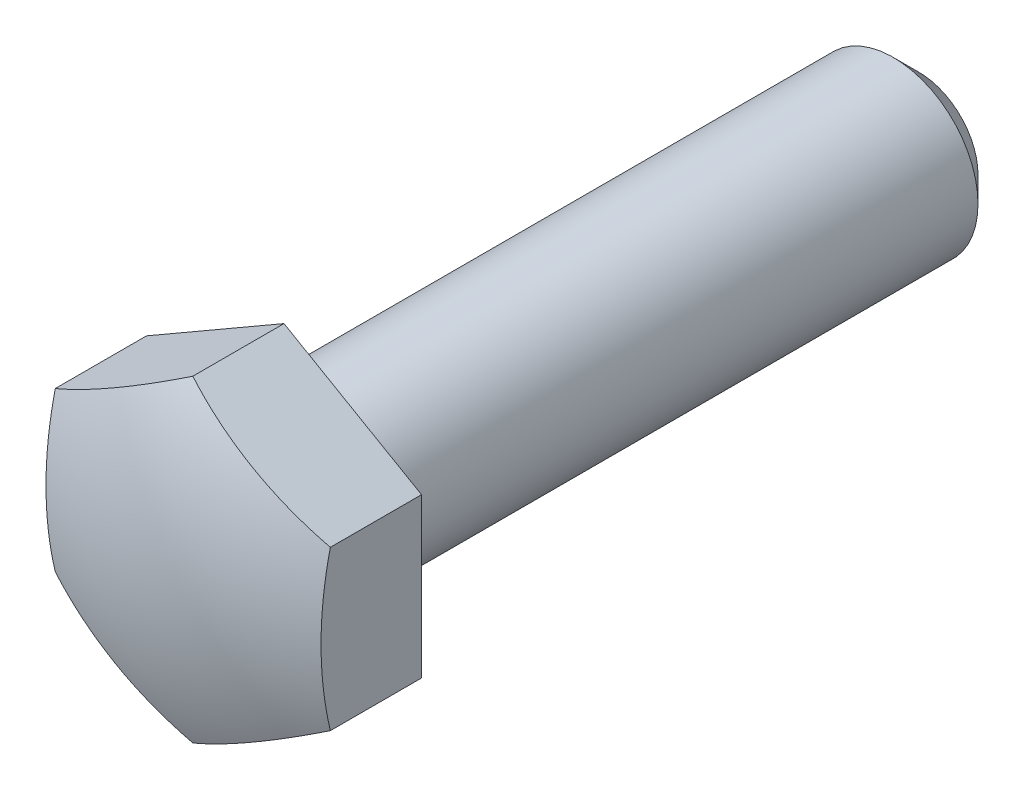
ISO-10303-21;
HEADER;
FILE_DESCRIPTION(('STEP AP214'),'2;1');
FILE_NAME('part.step','',(''),(''),'','','');
FILE_SCHEMA(('AUTOMOTIVE_DESIGN { 1 0 10303 214 1 1 1 1 }'));
ENDSEC;
DATA;
#1=APPLICATION_CONTEXT('core data for automotive mechanical design processes');
#2=APPLICATION_PROTOCOL_DEFINITION('international standard','automotive_design',2000,#1);
#3=PRODUCT_CONTEXT('',#1,'mechanical');
#4=PRODUCT('Part','Part','',(#3));
#5=PRODUCT_RELATED_PRODUCT_CATEGORY('part','',(#4));
#6=PRODUCT_DEFINITION_FORMATION('','',#4);
#7=PRODUCT_DEFINITION_CONTEXT('part definition',#1,'design');
#8=PRODUCT_DEFINITION('design','',#6,#7);
#9=PRODUCT_DEFINITION_SHAPE('','',#8);
#10=(LENGTH_UNIT() NAMED_UNIT(*) SI_UNIT(.MILLI.,.METRE.));
#11=(NAMED_UNIT(*) PLANE_ANGLE_UNIT() SI_UNIT($,.RADIAN.));
#12=(NAMED_UNIT(*) SI_UNIT($,.STERADIAN.) SOLID_ANGLE_UNIT());
#13=UNCERTAINTY_MEASURE_WITH_UNIT(LENGTH_MEASURE(1.E-05),#10,'distance_accuracy_value','');
#14=(GEOMETRIC_REPRESENTATION_CONTEXT(3) GLOBAL_UNCERTAINTY_ASSIGNED_CONTEXT((#13)) GLOBAL_UNIT_ASSIGNED_CONTEXT((#10,
#11,#12)) REPRESENTATION_CONTEXT('',''));
#15=CARTESIAN_POINT('',(0.,0.,0.));
#16=DIRECTION('',(0.,0.,1.));
#17=DIRECTION('',(1.,0.,0.));
#18=AXIS2_PLACEMENT_3D('',#15,#16,#17);
#19=CARTESIAN_POINT('',(4.,0.,0.));
#20=DIRECTION('',(0.,0.,1.));
#21=DIRECTION('',(1.,0.,0.));
#22=AXIS2_PLACEMENT_3D('',#19,#20,#21);
#23=PLANE('',#22);
#24=CARTESIAN_POINT('',(0.,0.,0.));
#25=DIRECTION('',(0.,0.,1.));
#26=DIRECTION('',(1.,0.,0.));
#27=AXIS2_PLACEMENT_3D('',#24,#25,#26);
#28=CIRCLE('',#27,4.);
#29=CARTESIAN_POINT('',(4.,0.,0.));
#30=VERTEX_POINT('',#29);
#31=EDGE_CURVE('E115',#30,#30,#28,.T.);
#32=ORIENTED_EDGE('',*,*,#31,.T.);
#33=EDGE_LOOP('',(#32));
#34=FACE_BOUND('',#33,.T.);
#35=DIRECTION('',(-0.86602540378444,-0.5,0.));
#36=VECTOR('',#35,1.);
#37=CARTESIAN_POINT('',(6.5,-3.75277674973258,0.));
#38=LINE('',#37,#36);
#39=CARTESIAN_POINT('',(6.5,-3.75277674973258,0.));
#40=VERTEX_POINT('',#39);
#41=CARTESIAN_POINT('',(0.,-7.50555349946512,0.));
#42=VERTEX_POINT('',#41);
#43=EDGE_CURVE('E89',#40,#42,#38,.T.);
#44=ORIENTED_EDGE('',*,*,#43,.T.);
#45=DIRECTION('',(0.86602540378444,-0.5,0.));
#46=VECTOR('',#45,1.);
#47=CARTESIAN_POINT('',(-6.5,-3.75277674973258,0.));
#48=LINE('',#47,#46);
#49=CARTESIAN_POINT('',(-6.5,-3.75277674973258,0.));
#50=VERTEX_POINT('',#49);
#51=EDGE_CURVE('E87',#50,#42,#48,.T.);
#52=ORIENTED_EDGE('',*,*,#51,.F.);
#53=DIRECTION('',(0.,-1.,0.));
#54=VECTOR('',#53,1.);
#55=CARTESIAN_POINT('',(-6.5,3.75277674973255,0.));
#56=LINE('',#55,#54);
#57=CARTESIAN_POINT('',(-6.5,3.75277674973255,0.));
#58=VERTEX_POINT('',#57);
#59=EDGE_CURVE('E37',#58,#50,#56,.T.);
#60=ORIENTED_EDGE('',*,*,#59,.F.);
#61=DIRECTION('',(0.866025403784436,0.5,0.));
#62=VECTOR('',#61,1.);
#63=CARTESIAN_POINT('',(-6.5,3.75277674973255,0.));
#64=LINE('',#63,#62);
#65=CARTESIAN_POINT('',(0.,7.50555349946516,0.));
#66=VERTEX_POINT('',#65);
#67=EDGE_CURVE('E77',#58,#66,#64,.T.);
#68=ORIENTED_EDGE('',*,*,#67,.T.);
#69=DIRECTION('',(-0.866025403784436,0.5,0.));
#70=VECTOR('',#69,1.);
#71=CARTESIAN_POINT('',(6.5,3.75277674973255,0.));
#72=LINE('',#71,#70);
#73=CARTESIAN_POINT('',(6.5,3.75277674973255,0.));
#74=VERTEX_POINT('',#73);
#75=EDGE_CURVE('E83',#74,#66,#72,.T.);
#76=ORIENTED_EDGE('',*,*,#75,.F.);
#77=DIRECTION('',(0.,-1.,0.));
#78=VECTOR('',#77,1.);
#79=CARTESIAN_POINT('',(6.5,3.75277674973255,0.));
#80=LINE('',#79,#78);
#81=EDGE_CURVE('E95',#74,#40,#80,.T.);
#82=ORIENTED_EDGE('',*,*,#81,.T.);
#83=EDGE_LOOP('',(#44,#52,#60,#68,#76,#82));
#84=FACE_BOUND('',#83,.T.);
#85=ADVANCED_FACE('F14',(#34,#84),#23,.F.);
#86=CARTESIAN_POINT('',(0.,0.,30.));
#87=DIRECTION('',(0.,0.,1.));
#88=DIRECTION('',(1.,0.,0.));
#89=AXIS2_PLACEMENT_3D('',#86,#87,#88);
#90=CYLINDRICAL_SURFACE('',#89,4.);
#91=CARTESIAN_POINT('',(0.,0.,-28.8));
#92=DIRECTION('',(0.,0.,1.));
#93=DIRECTION('',(1.,0.,0.));
#94=AXIS2_PLACEMENT_3D('',#91,#92,#93);
#95=CIRCLE('',#94,4.);
#96=CARTESIAN_POINT('',(4.,0.,-28.8));
#97=VERTEX_POINT('',#96);
#98=EDGE_CURVE('E22',#97,#97,#95,.T.);
#99=ORIENTED_EDGE('',*,*,#98,.T.);
#100=EDGE_LOOP('',(#99));
#101=FACE_BOUND('',#100,.T.);
#102=ORIENTED_EDGE('',*,*,#31,.F.);
#103=EDGE_LOOP('',(#102));
#104=FACE_BOUND('',#103,.T.);
#105=ADVANCED_FACE('F120',(#101,#104),#90,.T.);
#106=CARTESIAN_POINT('',(0.,0.,-30.));
#107=DIRECTION('',(0.,0.,1.));
#108=DIRECTION('',(1.,0.,0.));
#109=AXIS2_PLACEMENT_3D('',#106,#107,#108);
#110=PLANE('',#109);
#111=CARTESIAN_POINT('',(0.,0.,-30.));
#112=DIRECTION('',(0.,0.,1.));
#113=DIRECTION('',(1.,0.,0.));
#114=AXIS2_PLACEMENT_3D('',#111,#112,#113);
#115=CIRCLE('',#114,2.8);
#116=CARTESIAN_POINT('',(2.8,0.,-30.));
#117=VERTEX_POINT('',#116);
#118=EDGE_CURVE('E9',#117,#117,#115,.F.);
#119=ORIENTED_EDGE('',*,*,#118,.T.);
#120=EDGE_LOOP('',(#119));
#121=FACE_BOUND('',#120,.T.);
#122=ADVANCED_FACE('F141',(#121),#110,.F.);
#123=CARTESIAN_POINT('',(6.5,-3.75277674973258,6.));
#124=DIRECTION('',(0.5,-0.86602540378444,0.));
#125=DIRECTION('',(0.86602540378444,0.5,0.));
#126=AXIS2_PLACEMENT_3D('',#123,#124,#125);
#127=PLANE('',#126);
#128=DIRECTION('',(0.,0.,-1.));
#129=VECTOR('',#128,1.);
#130=CARTESIAN_POINT('',(0.,-7.50555349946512,6.));
#131=LINE('',#130,#129);
#132=CARTESIAN_POINT('',(0.,-7.50555349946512,4.3087528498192));
#133=VERTEX_POINT('',#132);
#134=EDGE_CURVE('E29',#133,#42,#131,.T.);
#135=ORIENTED_EDGE('',*,*,#134,.T.);
#136=ORIENTED_EDGE('',*,*,#43,.F.);
#137=DIRECTION('',(0.,0.,-1.));
#138=VECTOR('',#137,1.);
#139=CARTESIAN_POINT('',(6.5,-3.75277674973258,6.));
#140=LINE('',#139,#138);
#141=CARTESIAN_POINT('',(6.5,-3.75277674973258,4.3087528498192));
#142=VERTEX_POINT('',#141);
#143=EDGE_CURVE('E100',#142,#40,#140,.T.);
#144=ORIENTED_EDGE('',*,*,#143,.F.);
#145=CARTESIAN_POINT('',(3.25,-5.62916512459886,-11.5));
#146=DIRECTION('',(0.5,-0.86602540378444,0.));
#147=DIRECTION('',(0.86602540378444,0.5,0.));
#148=AXIS2_PLACEMENT_3D('',#145,#146,#147);
#149=CIRCLE('',#148,16.2480768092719);
#150=EDGE_CURVE('E112',#133,#142,#149,.F.);
#151=ORIENTED_EDGE('',*,*,#150,.F.);
#152=EDGE_LOOP('',(#135,#136,#144,#151));
#153=FACE_BOUND('',#152,.T.);
#154=ADVANCED_FACE('F146',(#153),#127,.T.);
#155=CARTESIAN_POINT('',(6.5,3.75277674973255,6.));
#156=DIRECTION('',(1.,0.,0.));
#157=DIRECTION('',(0.,1.,0.));
#158=AXIS2_PLACEMENT_3D('',#155,#156,#157);
#159=PLANE('',#158);
#160=ORIENTED_EDGE('',*,*,#143,.T.);
#161=ORIENTED_EDGE('',*,*,#81,.F.);
#162=DIRECTION('',(0.,0.,-1.));
#163=VECTOR('',#162,1.);
#164=CARTESIAN_POINT('',(6.5,3.75277674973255,6.));
#165=LINE('',#164,#163);
#166=CARTESIAN_POINT('',(6.5,3.75277674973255,4.3087528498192));
#167=VERTEX_POINT('',#166);
#168=EDGE_CURVE('E98',#167,#74,#165,.T.);
#169=ORIENTED_EDGE('',*,*,#168,.F.);
#170=CARTESIAN_POINT('',(6.5,0.,-11.5));
#171=DIRECTION('',(1.,0.,0.));
#172=DIRECTION('',(0.,1.,0.));
#173=AXIS2_PLACEMENT_3D('',#170,#171,#172);
#174=CIRCLE('',#173,16.2480768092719);
#175=EDGE_CURVE('E109',#142,#167,#174,.F.);
#176=ORIENTED_EDGE('',*,*,#175,.F.);
#177=EDGE_LOOP('',(#160,#161,#169,#176));
#178=FACE_BOUND('',#177,.T.);
#179=ADVANCED_FACE('F148',(#178),#159,.T.);
#180=CARTESIAN_POINT('',(6.5,3.75277674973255,6.));
#181=DIRECTION('',(-0.5,-0.866025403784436,0.));
#182=DIRECTION('',(0.866025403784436,-0.5,0.));
#183=AXIS2_PLACEMENT_3D('',#180,#181,#182);
#184=PLANE('',#183);
#185=CARTESIAN_POINT('',(3.25,5.62916512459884,-11.5));
#186=DIRECTION('',(-0.5,-0.866025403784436,0.));
#187=DIRECTION('',(0.866025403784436,-0.5,0.));
#188=AXIS2_PLACEMENT_3D('',#185,#186,#187);
#189=CIRCLE('',#188,16.2480768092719);
#190=CARTESIAN_POINT('',(0.,7.50555349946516,4.3087528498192));
#191=VERTEX_POINT('',#190);
#192=EDGE_CURVE('E107',#191,#167,#189,.F.);
#193=ORIENTED_EDGE('',*,*,#192,.T.);
#194=ORIENTED_EDGE('',*,*,#168,.T.);
#195=ORIENTED_EDGE('',*,*,#75,.T.);
#196=DIRECTION('',(0.,0.,-1.));
#197=VECTOR('',#196,1.);
#198=CARTESIAN_POINT('',(0.,7.50555349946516,6.));
#199=LINE('',#198,#197);
#200=EDGE_CURVE('E73',#191,#66,#199,.T.);
#201=ORIENTED_EDGE('',*,*,#200,.F.);
#202=EDGE_LOOP('',(#193,#194,#195,#201));
#203=FACE_BOUND('',#202,.T.);
#204=ADVANCED_FACE('F151',(#203),#184,.F.);
#205=CARTESIAN_POINT('',(-6.5,3.75277674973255,6.));
#206=DIRECTION('',(-0.5,0.866025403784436,0.));
#207=DIRECTION('',(-0.866025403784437,-0.5,0.));
#208=AXIS2_PLACEMENT_3D('',#205,#206,#207);
#209=PLANE('',#208);
#210=ORIENTED_EDGE('',*,*,#200,.T.);
#211=ORIENTED_EDGE('',*,*,#67,.F.);
#212=DIRECTION('',(0.,0.,-1.));
#213=VECTOR('',#212,1.);
#214=CARTESIAN_POINT('',(-6.5,3.75277674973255,6.));
#215=LINE('',#214,#213);
#216=CARTESIAN_POINT('',(-6.5,3.75277674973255,4.3087528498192));
#217=VERTEX_POINT('',#216);
#218=EDGE_CURVE('E66',#217,#58,#215,.T.);
#219=ORIENTED_EDGE('',*,*,#218,.F.);
#220=CARTESIAN_POINT('',(-3.25,5.62916512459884,-11.5));
#221=DIRECTION('',(-0.5,0.866025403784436,0.));
#222=DIRECTION('',(-0.866025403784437,-0.5,0.));
#223=AXIS2_PLACEMENT_3D('',#220,#221,#222);
#224=CIRCLE('',#223,16.2480768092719);
#225=EDGE_CURVE('E105',#191,#217,#224,.F.);
#226=ORIENTED_EDGE('',*,*,#225,.F.);
#227=EDGE_LOOP('',(#210,#211,#219,#226));
#228=FACE_BOUND('',#227,.T.);
#229=ADVANCED_FACE('F78',(#228),#209,.T.);
#230=CARTESIAN_POINT('',(-6.5,3.75277674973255,6.));
#231=DIRECTION('',(1.,0.,0.));
#232=DIRECTION('',(0.,0.,-1.));
#233=AXIS2_PLACEMENT_3D('',#230,#231,#232);
#234=PLANE('',#233);
#235=CARTESIAN_POINT('',(-6.5,0.,-11.5));
#236=DIRECTION('',(1.,0.,0.));
#237=DIRECTION('',(0.,0.,-1.));
#238=AXIS2_PLACEMENT_3D('',#235,#236,#237);
#239=CIRCLE('',#238,16.2480768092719);
#240=CARTESIAN_POINT('',(-6.5,-3.75277674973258,4.3087528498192));
#241=VERTEX_POINT('',#240);
#242=EDGE_CURVE('E70',#241,#217,#239,.F.);
#243=ORIENTED_EDGE('',*,*,#242,.T.);
#244=ORIENTED_EDGE('',*,*,#218,.T.);
#245=ORIENTED_EDGE('',*,*,#59,.T.);
#246=DIRECTION('',(0.,0.,-1.));
#247=VECTOR('',#246,1.);
#248=CARTESIAN_POINT('',(-6.5,-3.75277674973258,6.));
#249=LINE('',#248,#247);
#250=EDGE_CURVE('E74',#241,#50,#249,.T.);
#251=ORIENTED_EDGE('',*,*,#250,.F.);
#252=EDGE_LOOP('',(#243,#244,#245,#251));
#253=FACE_BOUND('',#252,.T.);
#254=ADVANCED_FACE('F68',(#253),#234,.F.);
#255=CARTESIAN_POINT('',(-6.5,-3.75277674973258,6.));
#256=DIRECTION('',(0.5,0.86602540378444,0.));
#257=DIRECTION('',(-0.86602540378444,0.5,0.));
#258=AXIS2_PLACEMENT_3D('',#255,#256,#257);
#259=PLANE('',#258);
#260=CARTESIAN_POINT('',(-3.25,-5.62916512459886,-11.5));
#261=DIRECTION('',(0.5,0.86602540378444,0.));
#262=DIRECTION('',(-0.86602540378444,0.5,0.));
#263=AXIS2_PLACEMENT_3D('',#260,#261,#262);
#264=CIRCLE('',#263,16.2480768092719);
#265=EDGE_CURVE('E102',#133,#241,#264,.F.);
#266=ORIENTED_EDGE('',*,*,#265,.T.);
#267=ORIENTED_EDGE('',*,*,#250,.T.);
#268=ORIENTED_EDGE('',*,*,#51,.T.);
#269=ORIENTED_EDGE('',*,*,#134,.F.);
#270=EDGE_LOOP('',(#266,#267,#268,#269));
#271=FACE_BOUND('',#270,.T.);
#272=ADVANCED_FACE('F131',(#271),#259,.F.);
#273=CARTESIAN_POINT('',(0.,0.,-11.5));
#274=DIRECTION('',(0.,0.,1.));
#275=DIRECTION('',(1.,0.,0.));
#276=AXIS2_PLACEMENT_3D('',#273,#274,#275);
#277=SPHERICAL_SURFACE('',#276,17.5);
#278=ORIENTED_EDGE('',*,*,#265,.F.);
#279=ORIENTED_EDGE('',*,*,#150,.T.);
#280=ORIENTED_EDGE('',*,*,#175,.T.);
#281=ORIENTED_EDGE('',*,*,#192,.F.);
#282=ORIENTED_EDGE('',*,*,#225,.T.);
#283=ORIENTED_EDGE('',*,*,#242,.F.);
#284=EDGE_LOOP('',(#278,#279,#280,#281,#282,#283));
#285=FACE_BOUND('',#284,.T.);
#286=ADVANCED_FACE('F124',(#285),#277,.T.);
#287=CARTESIAN_POINT('',(0.,0.,-28.8));
#288=DIRECTION('',(0.,0.,1.));
#289=DIRECTION('',(1.,0.,0.));
#290=AXIS2_PLACEMENT_3D('',#287,#288,#289);
#291=CONICAL_SURFACE('',#290,4.,0.78539816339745);
#292=ORIENTED_EDGE('',*,*,#118,.F.);
#293=EDGE_LOOP('',(#292));
#294=FACE_BOUND('',#293,.T.);
#295=ORIENTED_EDGE('',*,*,#98,.F.);
#296=EDGE_LOOP('',(#295));
#297=FACE_BOUND('',#296,.T.);
#298=ADVANCED_FACE('F16',(#294,#297),#291,.T.);
#299=CLOSED_SHELL('',(#85,#105,#122,#154,#179,#204,#229,#254,#272,#286,#298));
#300=MANIFOLD_SOLID_BREP('B1',#299);
#301=ADVANCED_BREP_SHAPE_REPRESENTATION('',(#18,#300),#14);
#302=SHAPE_DEFINITION_REPRESENTATION(#9,#301);
ENDSEC;
END-ISO-10303-21;
